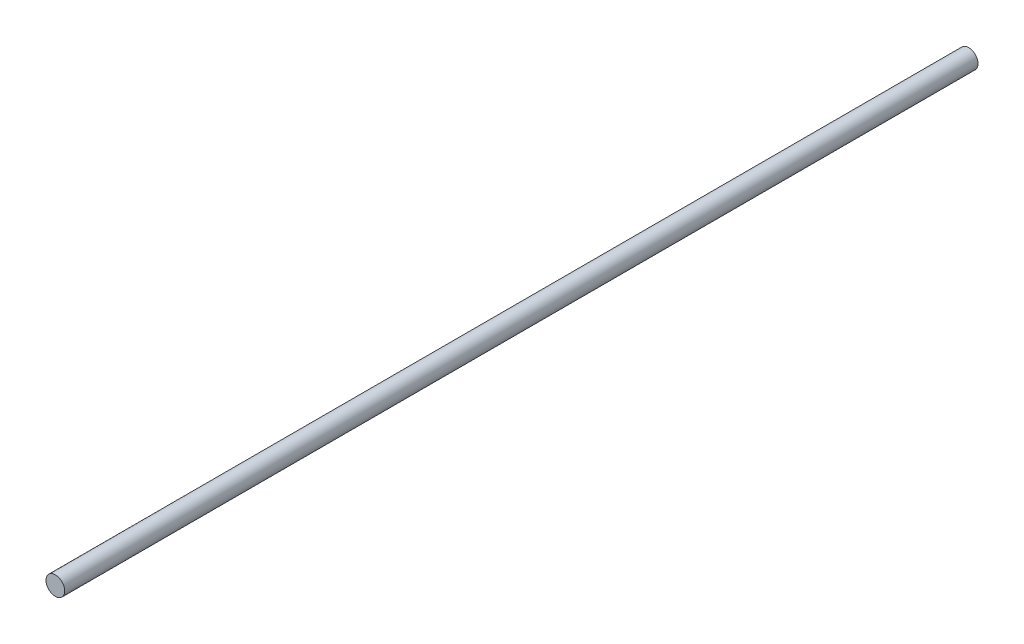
from build123d import *

# Parameters (mm, degrees)
SKETCH1_R           = 4
BOSS_EXTRUDE1_DEPTH = 195


with BuildPart() as part:
    # Sketch1 → Boss-Extrude1 (new, symmetric)
    with BuildSketch(Plane.XY):
        Circle(SKETCH1_R)
    extrude(amount=BOSS_EXTRUDE1_DEPTH, both=True)


solid = part.part
